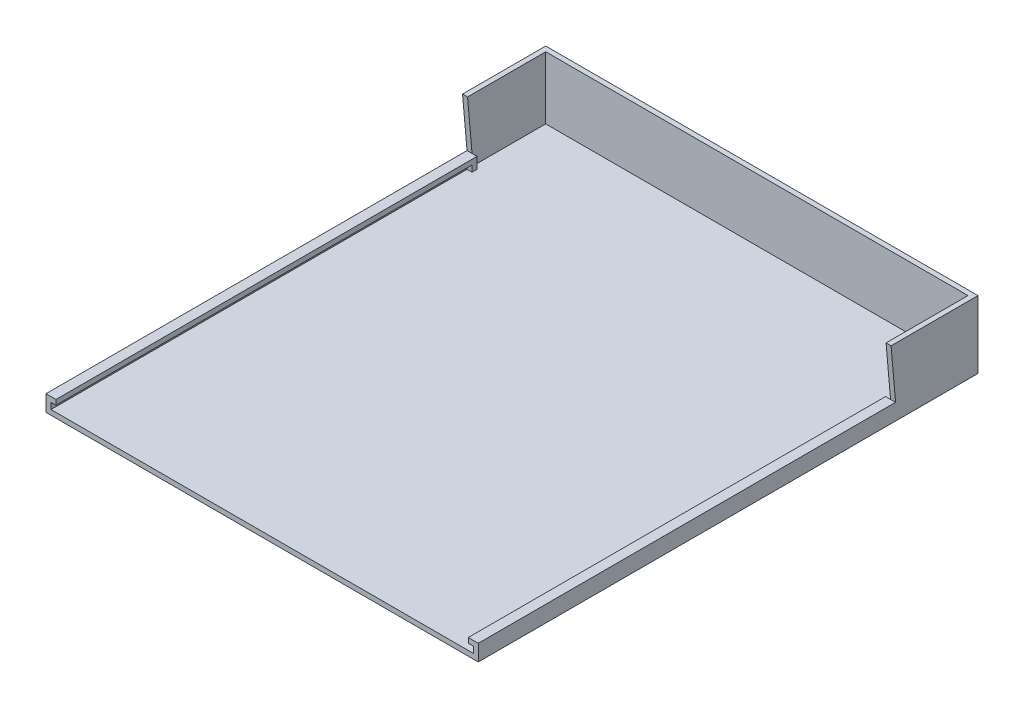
ISO-10303-21;
HEADER;
FILE_DESCRIPTION(('STEP AP214'),'2;1');
FILE_NAME('part.step','',(''),(''),'','','');
FILE_SCHEMA(('AUTOMOTIVE_DESIGN { 1 0 10303 214 1 1 1 1 }'));
ENDSEC;
DATA;
#1=APPLICATION_CONTEXT('core data for automotive mechanical design processes');
#2=APPLICATION_PROTOCOL_DEFINITION('international standard','automotive_design',2000,#1);
#3=PRODUCT_CONTEXT('',#1,'mechanical');
#4=PRODUCT('Part','Part','',(#3));
#5=PRODUCT_RELATED_PRODUCT_CATEGORY('part','',(#4));
#6=PRODUCT_DEFINITION_FORMATION('','',#4);
#7=PRODUCT_DEFINITION_CONTEXT('part definition',#1,'design');
#8=PRODUCT_DEFINITION('design','',#6,#7);
#9=PRODUCT_DEFINITION_SHAPE('','',#8);
#10=(LENGTH_UNIT() NAMED_UNIT(*) SI_UNIT(.MILLI.,.METRE.));
#11=(NAMED_UNIT(*) PLANE_ANGLE_UNIT() SI_UNIT($,.RADIAN.));
#12=(NAMED_UNIT(*) SI_UNIT($,.STERADIAN.) SOLID_ANGLE_UNIT());
#13=UNCERTAINTY_MEASURE_WITH_UNIT(LENGTH_MEASURE(1.E-05),#10,'distance_accuracy_value','');
#14=(GEOMETRIC_REPRESENTATION_CONTEXT(3) GLOBAL_UNCERTAINTY_ASSIGNED_CONTEXT((#13)) GLOBAL_UNIT_ASSIGNED_CONTEXT((#10,
#11,#12)) REPRESENTATION_CONTEXT('',''));
#15=CARTESIAN_POINT('',(0.,0.,0.));
#16=DIRECTION('',(0.,0.,1.));
#17=DIRECTION('',(1.,0.,0.));
#18=AXIS2_PLACEMENT_3D('',#15,#16,#17);
#19=CARTESIAN_POINT('',(0.,2.,0.));
#20=DIRECTION('',(0.,-1.,0.));
#21=DIRECTION('',(0.,0.,-1.));
#22=AXIS2_PLACEMENT_3D('',#19,#20,#21);
#23=PLANE('',#22);
#24=DIRECTION('',(-1.,0.,0.));
#25=VECTOR('',#24,1.);
#26=CARTESIAN_POINT('',(82.5,2.,-67.));
#27=LINE('',#26,#25);
#28=CARTESIAN_POINT('',(84.5,2.,-67.));
#29=VERTEX_POINT('',#28);
#30=CARTESIAN_POINT('',(82.5,2.,-67.));
#31=VERTEX_POINT('',#30);
#32=EDGE_CURVE('E268',#29,#31,#27,.T.);
#33=ORIENTED_EDGE('',*,*,#32,.F.);
#34=DIRECTION('',(0.,0.,-1.));
#35=VECTOR('',#34,1.);
#36=CARTESIAN_POINT('',(84.5,2.,-67.));
#37=LINE('',#36,#35);
#38=CARTESIAN_POINT('',(84.5,2.,-98.));
#39=VERTEX_POINT('',#38);
#40=EDGE_CURVE('E65',#29,#39,#37,.T.);
#41=ORIENTED_EDGE('',*,*,#40,.T.);
#42=DIRECTION('',(-1.,0.,0.));
#43=VECTOR('',#42,1.);
#44=CARTESIAN_POINT('',(84.5,2.,-98.));
#45=LINE('',#44,#43);
#46=CARTESIAN_POINT('',(-84.5,2.,-98.));
#47=VERTEX_POINT('',#46);
#48=EDGE_CURVE('E60',#39,#47,#45,.T.);
#49=ORIENTED_EDGE('',*,*,#48,.T.);
#50=DIRECTION('',(0.,0.,1.));
#51=VECTOR('',#50,1.);
#52=CARTESIAN_POINT('',(-84.5,2.,-98.));
#53=LINE('',#52,#51);
#54=CARTESIAN_POINT('',(-84.5,2.,-68.5));
#55=VERTEX_POINT('',#54);
#56=EDGE_CURVE('E199',#47,#55,#53,.T.);
#57=ORIENTED_EDGE('',*,*,#56,.T.);
#58=DIRECTION('',(-1.,0.,0.));
#59=VECTOR('',#58,1.);
#60=CARTESIAN_POINT('',(-86.5,2.,-68.5));
#61=LINE('',#60,#59);
#62=CARTESIAN_POINT('',(-82.5,2.,-68.5));
#63=VERTEX_POINT('',#62);
#64=EDGE_CURVE('E253',#63,#55,#61,.T.);
#65=ORIENTED_EDGE('',*,*,#64,.F.);
#66=DIRECTION('',(0.,0.,-1.));
#67=VECTOR('',#66,1.);
#68=CARTESIAN_POINT('',(-82.5,2.,-66.5));
#69=LINE('',#68,#67);
#70=CARTESIAN_POINT('',(-82.5,2.,-66.5));
#71=VERTEX_POINT('',#70);
#72=EDGE_CURVE('E249',#71,#63,#69,.T.);
#73=ORIENTED_EDGE('',*,*,#72,.F.);
#74=DIRECTION('',(1.,0.,0.));
#75=VECTOR('',#74,1.);
#76=CARTESIAN_POINT('',(-86.5,2.,-66.5));
#77=LINE('',#76,#75);
#78=CARTESIAN_POINT('',(-84.5,2.,-66.5));
#79=VERTEX_POINT('',#78);
#80=EDGE_CURVE('E246',#79,#71,#77,.T.);
#81=ORIENTED_EDGE('',*,*,#80,.F.);
#82=DIRECTION('',(0.,0.,-1.));
#83=VECTOR('',#82,1.);
#84=CARTESIAN_POINT('',(-84.5,2.,-100.));
#85=LINE('',#84,#83);
#86=CARTESIAN_POINT('',(-84.5,2.,100.));
#87=VERTEX_POINT('',#86);
#88=EDGE_CURVE('E315',#87,#79,#85,.T.);
#89=ORIENTED_EDGE('',*,*,#88,.F.);
#90=DIRECTION('',(1.,0.,0.));
#91=VECTOR('',#90,1.);
#92=CARTESIAN_POINT('',(-86.5,2.,100.));
#93=LINE('',#92,#91);
#94=CARTESIAN_POINT('',(84.5,2.,100.));
#95=VERTEX_POINT('',#94);
#96=EDGE_CURVE('E332',#87,#95,#93,.T.);
#97=ORIENTED_EDGE('',*,*,#96,.T.);
#98=DIRECTION('',(0.,0.,1.));
#99=VECTOR('',#98,1.);
#100=CARTESIAN_POINT('',(84.5,2.,-100.));
#101=LINE('',#100,#99);
#102=CARTESIAN_POINT('',(84.5,2.,-66.5));
#103=VERTEX_POINT('',#102);
#104=EDGE_CURVE('E321',#103,#95,#101,.T.);
#105=ORIENTED_EDGE('',*,*,#104,.F.);
#106=DIRECTION('',(1.,0.,0.));
#107=VECTOR('',#106,1.);
#108=CARTESIAN_POINT('',(82.5,2.,-66.5));
#109=LINE('',#108,#107);
#110=CARTESIAN_POINT('',(82.5,2.,-66.5));
#111=VERTEX_POINT('',#110);
#112=EDGE_CURVE('E270',#111,#103,#109,.T.);
#113=ORIENTED_EDGE('',*,*,#112,.F.);
#114=DIRECTION('',(0.,0.,1.));
#115=VECTOR('',#114,1.);
#116=CARTESIAN_POINT('',(82.5,2.,-66.5));
#117=LINE('',#116,#115);
#118=EDGE_CURVE('E250',#31,#111,#117,.T.);
#119=ORIENTED_EDGE('',*,*,#118,.F.);
#120=EDGE_LOOP('',(#33,#41,#49,#57,#65,#73,#81,#89,#97,#105,#113,#119));
#121=FACE_BOUND('',#120,.T.);
#122=ADVANCED_FACE('F45',(#121),#23,.F.);
#123=CARTESIAN_POINT('',(-86.5,2.,-100.));
#124=DIRECTION('',(0.,0.,-1.));
#125=DIRECTION('',(-1.,0.,0.));
#126=AXIS2_PLACEMENT_3D('',#123,#124,#125);
#127=PLANE('',#126);
#128=DIRECTION('',(0.,-1.,0.));
#129=VECTOR('',#128,1.);
#130=CARTESIAN_POINT('',(-86.5,2.,-100.));
#131=LINE('',#130,#129);
#132=CARTESIAN_POINT('',(-86.5,27.,-100.));
#133=VERTEX_POINT('',#132);
#134=CARTESIAN_POINT('',(-86.5,0.,-100.));
#135=VERTEX_POINT('',#134);
#136=EDGE_CURVE('E346',#133,#135,#131,.T.);
#137=ORIENTED_EDGE('',*,*,#136,.F.);
#138=DIRECTION('',(1.,0.,0.));
#139=VECTOR('',#138,1.);
#140=CARTESIAN_POINT('',(-86.5,27.,-100.));
#141=LINE('',#140,#139);
#142=CARTESIAN_POINT('',(86.5,27.,-100.));
#143=VERTEX_POINT('',#142);
#144=EDGE_CURVE('E228',#133,#143,#141,.T.);
#145=ORIENTED_EDGE('',*,*,#144,.T.);
#146=DIRECTION('',(0.,-1.,0.));
#147=VECTOR('',#146,1.);
#148=CARTESIAN_POINT('',(86.5,2.,-100.));
#149=LINE('',#148,#147);
#150=CARTESIAN_POINT('',(86.5,0.,-100.));
#151=VERTEX_POINT('',#150);
#152=EDGE_CURVE('E335',#143,#151,#149,.T.);
#153=ORIENTED_EDGE('',*,*,#152,.T.);
#154=DIRECTION('',(1.,0.,0.));
#155=VECTOR('',#154,1.);
#156=CARTESIAN_POINT('',(-86.5,0.,-100.));
#157=LINE('',#156,#155);
#158=EDGE_CURVE('E323',#135,#151,#157,.T.);
#159=ORIENTED_EDGE('',*,*,#158,.F.);
#160=EDGE_LOOP('',(#137,#145,#153,#159));
#161=FACE_BOUND('',#160,.T.);
#162=ADVANCED_FACE('F47',(#161),#127,.T.);
#163=CARTESIAN_POINT('',(84.5,6.5,-100.));
#164=DIRECTION('',(1.,0.,0.));
#165=DIRECTION('',(0.,0.,-1.));
#166=AXIS2_PLACEMENT_3D('',#163,#164,#165);
#167=PLANE('',#166);
#168=DIRECTION('',(0.,0.,1.));
#169=VECTOR('',#168,1.);
#170=CARTESIAN_POINT('',(84.5,4.5,-100.));
#171=LINE('',#170,#169);
#172=CARTESIAN_POINT('',(84.5,4.5,-66.5));
#173=VERTEX_POINT('',#172);
#174=CARTESIAN_POINT('',(84.5,4.5,100.));
#175=VERTEX_POINT('',#174);
#176=EDGE_CURVE('E285',#173,#175,#171,.T.);
#177=ORIENTED_EDGE('',*,*,#176,.F.);
#178=DIRECTION('',(0.,-1.,0.));
#179=VECTOR('',#178,1.);
#180=CARTESIAN_POINT('',(84.5,6.5,-66.5));
#181=LINE('',#180,#179);
#182=EDGE_CURVE('E279',#173,#103,#181,.T.);
#183=ORIENTED_EDGE('',*,*,#182,.T.);
#184=ORIENTED_EDGE('',*,*,#104,.T.);
#185=DIRECTION('',(0.,-1.,0.));
#186=VECTOR('',#185,1.);
#187=CARTESIAN_POINT('',(84.5,6.5,100.));
#188=LINE('',#187,#186);
#189=EDGE_CURVE('E311',#175,#95,#188,.T.);
#190=ORIENTED_EDGE('',*,*,#189,.F.);
#191=EDGE_LOOP('',(#177,#183,#184,#190));
#192=FACE_BOUND('',#191,.T.);
#193=ADVANCED_FACE('F428',(#192),#167,.F.);
#194=CARTESIAN_POINT('',(-84.5,6.5,-100.));
#195=DIRECTION('',(-1.,0.,0.));
#196=DIRECTION('',(0.,0.,1.));
#197=AXIS2_PLACEMENT_3D('',#194,#195,#196);
#198=PLANE('',#197);
#199=ORIENTED_EDGE('',*,*,#88,.T.);
#200=DIRECTION('',(0.,1.,0.));
#201=VECTOR('',#200,1.);
#202=CARTESIAN_POINT('',(-84.5,6.5,-66.5));
#203=LINE('',#202,#201);
#204=CARTESIAN_POINT('',(-84.5,4.5,-66.5));
#205=VERTEX_POINT('',#204);
#206=EDGE_CURVE('E283',#79,#205,#203,.T.);
#207=ORIENTED_EDGE('',*,*,#206,.T.);
#208=DIRECTION('',(0.,0.,-1.));
#209=VECTOR('',#208,1.);
#210=CARTESIAN_POINT('',(-84.5,4.5,100.));
#211=LINE('',#210,#209);
#212=CARTESIAN_POINT('',(-84.5,4.5,100.));
#213=VERTEX_POINT('',#212);
#214=EDGE_CURVE('E298',#213,#205,#211,.T.);
#215=ORIENTED_EDGE('',*,*,#214,.F.);
#216=DIRECTION('',(0.,-1.,0.));
#217=VECTOR('',#216,1.);
#218=CARTESIAN_POINT('',(-84.5,6.5,100.));
#219=LINE('',#218,#217);
#220=EDGE_CURVE('E318',#213,#87,#219,.T.);
#221=ORIENTED_EDGE('',*,*,#220,.T.);
#222=EDGE_LOOP('',(#199,#207,#215,#221));
#223=FACE_BOUND('',#222,.T.);
#224=ADVANCED_FACE('F376',(#223),#198,.F.);
#225=CARTESIAN_POINT('',(-86.5,2.,-100.));
#226=DIRECTION('',(1.,0.,0.));
#227=DIRECTION('',(0.,0.,-1.));
#228=AXIS2_PLACEMENT_3D('',#225,#226,#227);
#229=PLANE('',#228);
#230=DIRECTION('',(0.,0.,1.));
#231=VECTOR('',#230,1.);
#232=CARTESIAN_POINT('',(-86.5,6.5,-100.));
#233=LINE('',#232,#231);
#234=CARTESIAN_POINT('',(-86.5,6.5,-68.5));
#235=VERTEX_POINT('',#234);
#236=CARTESIAN_POINT('',(-86.5,6.5,100.));
#237=VERTEX_POINT('',#236);
#238=EDGE_CURVE('E312',#235,#237,#233,.T.);
#239=ORIENTED_EDGE('',*,*,#238,.F.);
#240=DIRECTION('',(0.,0.996194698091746,0.0871557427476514));
#241=VECTOR('',#240,1.);
#242=CARTESIAN_POINT('',(-86.5,27.,-66.7064823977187));
#243=LINE('',#242,#241);
#244=CARTESIAN_POINT('',(-86.5,27.,-66.7064823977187));
#245=VERTEX_POINT('',#244);
#246=EDGE_CURVE('E208',#235,#245,#243,.T.);
#247=ORIENTED_EDGE('',*,*,#246,.T.);
#248=DIRECTION('',(0.,0.,1.));
#249=VECTOR('',#248,1.);
#250=CARTESIAN_POINT('',(-86.5,27.,-98.));
#251=LINE('',#250,#249);
#252=EDGE_CURVE('E226',#133,#245,#251,.T.);
#253=ORIENTED_EDGE('',*,*,#252,.F.);
#254=ORIENTED_EDGE('',*,*,#136,.T.);
#255=DIRECTION('',(0.,0.,1.));
#256=VECTOR('',#255,1.);
#257=CARTESIAN_POINT('',(-86.5,0.,-100.));
#258=LINE('',#257,#256);
#259=CARTESIAN_POINT('',(-86.5,0.,100.));
#260=VERTEX_POINT('',#259);
#261=EDGE_CURVE('E336',#135,#260,#258,.T.);
#262=ORIENTED_EDGE('',*,*,#261,.T.);
#263=DIRECTION('',(0.,-1.,0.));
#264=VECTOR('',#263,1.);
#265=CARTESIAN_POINT('',(-86.5,2.,100.));
#266=LINE('',#265,#264);
#267=EDGE_CURVE('E348',#237,#260,#266,.T.);
#268=ORIENTED_EDGE('',*,*,#267,.F.);
#269=EDGE_LOOP('',(#239,#247,#253,#254,#262,#268));
#270=FACE_BOUND('',#269,.T.);
#271=ADVANCED_FACE('F413',(#270),#229,.F.);
#272=CARTESIAN_POINT('',(-86.5,2.,100.));
#273=DIRECTION('',(0.,0.,-1.));
#274=DIRECTION('',(-1.,0.,0.));
#275=AXIS2_PLACEMENT_3D('',#272,#273,#274);
#276=PLANE('',#275);
#277=DIRECTION('',(1.,0.,0.));
#278=VECTOR('',#277,1.);
#279=CARTESIAN_POINT('',(-86.5,0.,100.));
#280=LINE('',#279,#278);
#281=CARTESIAN_POINT('',(86.5,0.,100.));
#282=VERTEX_POINT('',#281);
#283=EDGE_CURVE('E342',#260,#282,#280,.T.);
#284=ORIENTED_EDGE('',*,*,#283,.T.);
#285=DIRECTION('',(0.,-1.,0.));
#286=VECTOR('',#285,1.);
#287=CARTESIAN_POINT('',(86.5,2.,100.));
#288=LINE('',#287,#286);
#289=CARTESIAN_POINT('',(86.5,6.5,100.));
#290=VERTEX_POINT('',#289);
#291=EDGE_CURVE('E351',#290,#282,#288,.T.);
#292=ORIENTED_EDGE('',*,*,#291,.F.);
#293=DIRECTION('',(1.,0.,0.));
#294=VECTOR('',#293,1.);
#295=CARTESIAN_POINT('',(84.5,6.5,100.));
#296=LINE('',#295,#294);
#297=CARTESIAN_POINT('',(82.5,6.5,100.));
#298=VERTEX_POINT('',#297);
#299=EDGE_CURVE('E328',#298,#290,#296,.T.);
#300=ORIENTED_EDGE('',*,*,#299,.F.);
#301=DIRECTION('',(0.,1.,0.));
#302=VECTOR('',#301,1.);
#303=CARTESIAN_POINT('',(82.5,6.5,100.));
#304=LINE('',#303,#302);
#305=CARTESIAN_POINT('',(82.5,4.5,100.));
#306=VERTEX_POINT('',#305);
#307=EDGE_CURVE('E288',#306,#298,#304,.T.);
#308=ORIENTED_EDGE('',*,*,#307,.F.);
#309=DIRECTION('',(1.,0.,0.));
#310=VECTOR('',#309,1.);
#311=CARTESIAN_POINT('',(82.5,4.5,100.));
#312=LINE('',#311,#310);
#313=EDGE_CURVE('E294',#306,#175,#312,.T.);
#314=ORIENTED_EDGE('',*,*,#313,.T.);
#315=ORIENTED_EDGE('',*,*,#189,.T.);
#316=ORIENTED_EDGE('',*,*,#96,.F.);
#317=ORIENTED_EDGE('',*,*,#220,.F.);
#318=DIRECTION('',(-1.,0.,0.));
#319=VECTOR('',#318,1.);
#320=CARTESIAN_POINT('',(-82.5,4.5,100.));
#321=LINE('',#320,#319);
#322=CARTESIAN_POINT('',(-82.5,4.5,100.));
#323=VERTEX_POINT('',#322);
#324=EDGE_CURVE('E307',#323,#213,#321,.T.);
#325=ORIENTED_EDGE('',*,*,#324,.F.);
#326=DIRECTION('',(0.,-1.,0.));
#327=VECTOR('',#326,1.);
#328=CARTESIAN_POINT('',(-82.5,6.5,100.));
#329=LINE('',#328,#327);
#330=CARTESIAN_POINT('',(-82.5,6.5,100.));
#331=VERTEX_POINT('',#330);
#332=EDGE_CURVE('E299',#331,#323,#329,.T.);
#333=ORIENTED_EDGE('',*,*,#332,.F.);
#334=DIRECTION('',(1.,0.,0.));
#335=VECTOR('',#334,1.);
#336=CARTESIAN_POINT('',(-86.5,6.5,100.));
#337=LINE('',#336,#335);
#338=EDGE_CURVE('E314',#237,#331,#337,.T.);
#339=ORIENTED_EDGE('',*,*,#338,.F.);
#340=ORIENTED_EDGE('',*,*,#267,.T.);
#341=EDGE_LOOP('',(#284,#292,#300,#308,#314,#315,#316,#317,#325,#333,#339,#340));
#342=FACE_BOUND('',#341,.T.);
#343=ADVANCED_FACE('F387',(#342),#276,.F.);
#344=CARTESIAN_POINT('',(86.5,2.,-100.));
#345=DIRECTION('',(1.,0.,0.));
#346=DIRECTION('',(0.,0.,-1.));
#347=AXIS2_PLACEMENT_3D('',#344,#345,#346);
#348=PLANE('',#347);
#349=ORIENTED_EDGE('',*,*,#152,.F.);
#350=DIRECTION('',(0.,0.,1.));
#351=VECTOR('',#350,1.);
#352=CARTESIAN_POINT('',(86.5,27.,-100.));
#353=LINE('',#352,#351);
#354=CARTESIAN_POINT('',(86.5,27.,-65.2064823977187));
#355=VERTEX_POINT('',#354);
#356=EDGE_CURVE('E231',#143,#355,#353,.T.);
#357=ORIENTED_EDGE('',*,*,#356,.T.);
#358=DIRECTION('',(0.,-0.996194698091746,-0.0871557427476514));
#359=VECTOR('',#358,1.);
#360=CARTESIAN_POINT('',(86.5,27.,-65.2064823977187));
#361=LINE('',#360,#359);
#362=CARTESIAN_POINT('',(86.5,6.5,-67.));
#363=VERTEX_POINT('',#362);
#364=EDGE_CURVE('E207',#355,#363,#361,.T.);
#365=ORIENTED_EDGE('',*,*,#364,.T.);
#366=DIRECTION('',(0.,0.,-1.));
#367=VECTOR('',#366,1.);
#368=CARTESIAN_POINT('',(86.5,6.5,-100.));
#369=LINE('',#368,#367);
#370=EDGE_CURVE('E326',#290,#363,#369,.T.);
#371=ORIENTED_EDGE('',*,*,#370,.F.);
#372=ORIENTED_EDGE('',*,*,#291,.T.);
#373=DIRECTION('',(0.,0.,1.));
#374=VECTOR('',#373,1.);
#375=CARTESIAN_POINT('',(86.5,0.,-100.));
#376=LINE('',#375,#374);
#377=EDGE_CURVE('E339',#151,#282,#376,.T.);
#378=ORIENTED_EDGE('',*,*,#377,.F.);
#379=EDGE_LOOP('',(#349,#357,#365,#371,#372,#378));
#380=FACE_BOUND('',#379,.T.);
#381=ADVANCED_FACE('F404',(#380),#348,.T.);
#382=CARTESIAN_POINT('',(0.,0.,0.));
#383=DIRECTION('',(0.,-1.,0.));
#384=DIRECTION('',(0.,0.,-1.));
#385=AXIS2_PLACEMENT_3D('',#382,#383,#384);
#386=PLANE('',#385);
#387=ORIENTED_EDGE('',*,*,#158,.T.);
#388=ORIENTED_EDGE('',*,*,#377,.T.);
#389=ORIENTED_EDGE('',*,*,#283,.F.);
#390=ORIENTED_EDGE('',*,*,#261,.F.);
#391=EDGE_LOOP('',(#387,#388,#389,#390));
#392=FACE_BOUND('',#391,.T.);
#393=ADVANCED_FACE('F424',(#392),#386,.T.);
#394=CARTESIAN_POINT('',(0.,6.5,0.));
#395=DIRECTION('',(0.,1.,0.));
#396=DIRECTION('',(0.,0.,1.));
#397=AXIS2_PLACEMENT_3D('',#394,#395,#396);
#398=PLANE('',#397);
#399=ORIENTED_EDGE('',*,*,#370,.T.);
#400=DIRECTION('',(-1.,0.,0.));
#401=VECTOR('',#400,1.);
#402=CARTESIAN_POINT('',(82.5,6.5,-67.));
#403=LINE('',#402,#401);
#404=CARTESIAN_POINT('',(84.5,6.5,-67.));
#405=VERTEX_POINT('',#404);
#406=EDGE_CURVE('E271',#363,#405,#403,.T.);
#407=ORIENTED_EDGE('',*,*,#406,.T.);
#408=CARTESIAN_POINT('',(82.5,6.5,-67.));
#409=VERTEX_POINT('',#408);
#410=EDGE_CURVE('E267',#405,#409,#403,.T.);
#411=ORIENTED_EDGE('',*,*,#410,.T.);
#412=DIRECTION('',(0.,0.,-1.));
#413=VECTOR('',#412,1.);
#414=CARTESIAN_POINT('',(82.5,6.5,-100.));
#415=LINE('',#414,#413);
#416=EDGE_CURVE('E291',#298,#409,#415,.T.);
#417=ORIENTED_EDGE('',*,*,#416,.F.);
#418=ORIENTED_EDGE('',*,*,#299,.T.);
#419=EDGE_LOOP('',(#399,#407,#411,#417,#418));
#420=FACE_BOUND('',#419,.T.);
#421=ADVANCED_FACE('F401',(#420),#398,.T.);
#422=CARTESIAN_POINT('',(0.,6.5,0.));
#423=DIRECTION('',(0.,1.,0.));
#424=DIRECTION('',(0.,0.,1.));
#425=AXIS2_PLACEMENT_3D('',#422,#423,#424);
#426=PLANE('',#425);
#427=DIRECTION('',(0.,0.,1.));
#428=VECTOR('',#427,1.);
#429=CARTESIAN_POINT('',(-82.5,6.5,100.));
#430=LINE('',#429,#428);
#431=CARTESIAN_POINT('',(-82.5,6.5,-68.5));
#432=VERTEX_POINT('',#431);
#433=EDGE_CURVE('E305',#432,#331,#430,.T.);
#434=ORIENTED_EDGE('',*,*,#433,.F.);
#435=DIRECTION('',(-1.,0.,0.));
#436=VECTOR('',#435,1.);
#437=CARTESIAN_POINT('',(-86.5,6.5,-68.5));
#438=LINE('',#437,#436);
#439=CARTESIAN_POINT('',(-84.5,6.5,-68.5));
#440=VERTEX_POINT('',#439);
#441=EDGE_CURVE('E241',#432,#440,#438,.T.);
#442=ORIENTED_EDGE('',*,*,#441,.T.);
#443=EDGE_CURVE('E245',#440,#235,#438,.T.);
#444=ORIENTED_EDGE('',*,*,#443,.T.);
#445=ORIENTED_EDGE('',*,*,#238,.T.);
#446=ORIENTED_EDGE('',*,*,#338,.T.);
#447=EDGE_LOOP('',(#434,#442,#444,#445,#446));
#448=FACE_BOUND('',#447,.T.);
#449=ADVANCED_FACE('F420',(#448),#426,.T.);
#450=CARTESIAN_POINT('',(-82.5,4.5,100.));
#451=DIRECTION('',(0.,1.,0.));
#452=DIRECTION('',(0.,0.,1.));
#453=AXIS2_PLACEMENT_3D('',#450,#451,#452);
#454=PLANE('',#453);
#455=ORIENTED_EDGE('',*,*,#214,.T.);
#456=DIRECTION('',(1.,0.,0.));
#457=VECTOR('',#456,1.);
#458=CARTESIAN_POINT('',(-82.5,4.5,-66.5));
#459=LINE('',#458,#457);
#460=CARTESIAN_POINT('',(-82.5,4.5,-66.5));
#461=VERTEX_POINT('',#460);
#462=EDGE_CURVE('E281',#205,#461,#459,.T.);
#463=ORIENTED_EDGE('',*,*,#462,.T.);
#464=DIRECTION('',(0.,0.,-1.));
#465=VECTOR('',#464,1.);
#466=CARTESIAN_POINT('',(-82.5,4.5,100.));
#467=LINE('',#466,#465);
#468=EDGE_CURVE('E302',#323,#461,#467,.T.);
#469=ORIENTED_EDGE('',*,*,#468,.F.);
#470=ORIENTED_EDGE('',*,*,#324,.T.);
#471=EDGE_LOOP('',(#455,#463,#469,#470));
#472=FACE_BOUND('',#471,.T.);
#473=ADVANCED_FACE('F382',(#472),#454,.F.);
#474=CARTESIAN_POINT('',(-82.5,0.,0.));
#475=DIRECTION('',(1.,0.,0.));
#476=DIRECTION('',(0.,0.,-1.));
#477=AXIS2_PLACEMENT_3D('',#474,#475,#476);
#478=PLANE('',#477);
#479=ORIENTED_EDGE('',*,*,#468,.T.);
#480=DIRECTION('',(0.,-1.,0.));
#481=VECTOR('',#480,1.);
#482=CARTESIAN_POINT('',(-82.5,6.5,-66.5));
#483=LINE('',#482,#481);
#484=EDGE_CURVE('E258',#461,#71,#483,.T.);
#485=ORIENTED_EDGE('',*,*,#484,.T.);
#486=ORIENTED_EDGE('',*,*,#72,.T.);
#487=DIRECTION('',(0.,-1.,0.));
#488=VECTOR('',#487,1.);
#489=CARTESIAN_POINT('',(-82.5,6.5,-68.5));
#490=LINE('',#489,#488);
#491=EDGE_CURVE('E244',#432,#63,#490,.T.);
#492=ORIENTED_EDGE('',*,*,#491,.F.);
#493=ORIENTED_EDGE('',*,*,#433,.T.);
#494=ORIENTED_EDGE('',*,*,#332,.T.);
#495=EDGE_LOOP('',(#479,#485,#486,#492,#493,#494));
#496=FACE_BOUND('',#495,.T.);
#497=ADVANCED_FACE('F369',(#496),#478,.T.);
#498=CARTESIAN_POINT('',(82.5,4.5,-100.));
#499=DIRECTION('',(0.,1.,0.));
#500=DIRECTION('',(0.,0.,1.));
#501=AXIS2_PLACEMENT_3D('',#498,#499,#500);
#502=PLANE('',#501);
#503=DIRECTION('',(0.,0.,1.));
#504=VECTOR('',#503,1.);
#505=CARTESIAN_POINT('',(82.5,4.5,-100.));
#506=LINE('',#505,#504);
#507=CARTESIAN_POINT('',(82.5,4.5,-66.5));
#508=VERTEX_POINT('',#507);
#509=EDGE_CURVE('E286',#508,#306,#506,.T.);
#510=ORIENTED_EDGE('',*,*,#509,.F.);
#511=DIRECTION('',(1.,0.,0.));
#512=VECTOR('',#511,1.);
#513=CARTESIAN_POINT('',(82.5,4.5,-66.5));
#514=LINE('',#513,#512);
#515=EDGE_CURVE('E261',#508,#173,#514,.T.);
#516=ORIENTED_EDGE('',*,*,#515,.T.);
#517=ORIENTED_EDGE('',*,*,#176,.T.);
#518=ORIENTED_EDGE('',*,*,#313,.F.);
#519=EDGE_LOOP('',(#510,#516,#517,#518));
#520=FACE_BOUND('',#519,.T.);
#521=ADVANCED_FACE('F429',(#520),#502,.F.);
#522=CARTESIAN_POINT('',(82.5,0.,0.));
#523=DIRECTION('',(-1.,0.,0.));
#524=DIRECTION('',(0.,0.,1.));
#525=AXIS2_PLACEMENT_3D('',#522,#523,#524);
#526=PLANE('',#525);
#527=ORIENTED_EDGE('',*,*,#416,.T.);
#528=DIRECTION('',(0.,-1.,0.));
#529=VECTOR('',#528,1.);
#530=CARTESIAN_POINT('',(82.5,6.5,-67.));
#531=LINE('',#530,#529);
#532=EDGE_CURVE('E264',#409,#31,#531,.T.);
#533=ORIENTED_EDGE('',*,*,#532,.T.);
#534=ORIENTED_EDGE('',*,*,#118,.T.);
#535=DIRECTION('',(0.,-1.,0.));
#536=VECTOR('',#535,1.);
#537=CARTESIAN_POINT('',(82.5,6.5,-66.5));
#538=LINE('',#537,#536);
#539=EDGE_CURVE('E239',#508,#111,#538,.T.);
#540=ORIENTED_EDGE('',*,*,#539,.F.);
#541=ORIENTED_EDGE('',*,*,#509,.T.);
#542=ORIENTED_EDGE('',*,*,#307,.T.);
#543=EDGE_LOOP('',(#527,#533,#534,#540,#541,#542));
#544=FACE_BOUND('',#543,.T.);
#545=ADVANCED_FACE('F397',(#544),#526,.T.);
#546=CARTESIAN_POINT('',(-86.5,6.5,-66.5));
#547=DIRECTION('',(0.,0.,-1.));
#548=DIRECTION('',(-1.,0.,0.));
#549=AXIS2_PLACEMENT_3D('',#546,#547,#548);
#550=PLANE('',#549);
#551=ORIENTED_EDGE('',*,*,#462,.F.);
#552=ORIENTED_EDGE('',*,*,#206,.F.);
#553=ORIENTED_EDGE('',*,*,#80,.T.);
#554=ORIENTED_EDGE('',*,*,#484,.F.);
#555=EDGE_LOOP('',(#551,#552,#553,#554));
#556=FACE_BOUND('',#555,.T.);
#557=ADVANCED_FACE('F380',(#556),#550,.F.);
#558=CARTESIAN_POINT('',(-86.5,6.5,-68.5));
#559=DIRECTION('',(0.,0.,1.));
#560=DIRECTION('',(1.,0.,0.));
#561=AXIS2_PLACEMENT_3D('',#558,#559,#560);
#562=PLANE('',#561);
#563=ORIENTED_EDGE('',*,*,#64,.T.);
#564=DIRECTION('',(0.,1.,0.));
#565=VECTOR('',#564,1.);
#566=CARTESIAN_POINT('',(-84.5,6.5,-68.5));
#567=LINE('',#566,#565);
#568=EDGE_CURVE('E11',#55,#440,#567,.T.);
#569=ORIENTED_EDGE('',*,*,#568,.T.);
#570=ORIENTED_EDGE('',*,*,#441,.F.);
#571=ORIENTED_EDGE('',*,*,#491,.T.);
#572=EDGE_LOOP('',(#563,#569,#570,#571));
#573=FACE_BOUND('',#572,.T.);
#574=ADVANCED_FACE('F365',(#573),#562,.F.);
#575=CARTESIAN_POINT('',(82.5,6.5,-66.5));
#576=DIRECTION('',(0.,0.,-1.));
#577=DIRECTION('',(-1.,0.,0.));
#578=AXIS2_PLACEMENT_3D('',#575,#576,#577);
#579=PLANE('',#578);
#580=ORIENTED_EDGE('',*,*,#112,.T.);
#581=ORIENTED_EDGE('',*,*,#182,.F.);
#582=ORIENTED_EDGE('',*,*,#515,.F.);
#583=ORIENTED_EDGE('',*,*,#539,.T.);
#584=EDGE_LOOP('',(#580,#581,#582,#583));
#585=FACE_BOUND('',#584,.T.);
#586=ADVANCED_FACE('F393',(#585),#579,.F.);
#587=CARTESIAN_POINT('',(82.5,6.5,-67.));
#588=DIRECTION('',(0.,0.,1.));
#589=DIRECTION('',(1.,0.,0.));
#590=AXIS2_PLACEMENT_3D('',#587,#588,#589);
#591=PLANE('',#590);
#592=ORIENTED_EDGE('',*,*,#410,.F.);
#593=DIRECTION('',(0.,-1.,0.));
#594=VECTOR('',#593,1.);
#595=CARTESIAN_POINT('',(84.5,6.5,-67.));
#596=LINE('',#595,#594);
#597=EDGE_CURVE('E53',#405,#29,#596,.T.);
#598=ORIENTED_EDGE('',*,*,#597,.T.);
#599=ORIENTED_EDGE('',*,*,#32,.T.);
#600=ORIENTED_EDGE('',*,*,#532,.F.);
#601=EDGE_LOOP('',(#592,#598,#599,#600));
#602=FACE_BOUND('',#601,.T.);
#603=ADVANCED_FACE('F354',(#602),#591,.F.);
#604=CARTESIAN_POINT('',(84.5,27.,-67.));
#605=DIRECTION('',(-1.,0.,0.));
#606=DIRECTION('',(0.,0.,1.));
#607=AXIS2_PLACEMENT_3D('',#604,#605,#606);
#608=PLANE('',#607);
#609=ORIENTED_EDGE('',*,*,#40,.F.);
#610=ORIENTED_EDGE('',*,*,#597,.F.);
#611=DIRECTION('',(0.,-0.996194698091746,-0.0871557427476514));
#612=VECTOR('',#611,1.);
#613=CARTESIAN_POINT('',(84.5,27.,-65.2064823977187));
#614=LINE('',#613,#612);
#615=CARTESIAN_POINT('',(84.5,27.,-65.2064823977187));
#616=VERTEX_POINT('',#615);
#617=EDGE_CURVE('E205',#616,#405,#614,.T.);
#618=ORIENTED_EDGE('',*,*,#617,.F.);
#619=DIRECTION('',(0.,0.,-1.));
#620=VECTOR('',#619,1.);
#621=CARTESIAN_POINT('',(84.5,27.,-67.));
#622=LINE('',#621,#620);
#623=CARTESIAN_POINT('',(84.5,27.,-98.));
#624=VERTEX_POINT('',#623);
#625=EDGE_CURVE('E188',#616,#624,#622,.T.);
#626=ORIENTED_EDGE('',*,*,#625,.T.);
#627=DIRECTION('',(0.,-1.,0.));
#628=VECTOR('',#627,1.);
#629=CARTESIAN_POINT('',(84.5,27.,-98.));
#630=LINE('',#629,#628);
#631=EDGE_CURVE('E233',#624,#39,#630,.T.);
#632=ORIENTED_EDGE('',*,*,#631,.T.);
#633=EDGE_LOOP('',(#609,#610,#618,#626,#632));
#634=FACE_BOUND('',#633,.T.);
#635=ADVANCED_FACE('F211',(#634),#608,.T.);
#636=CARTESIAN_POINT('',(-84.5,27.,-98.));
#637=DIRECTION('',(1.,0.,0.));
#638=DIRECTION('',(0.,0.,-1.));
#639=AXIS2_PLACEMENT_3D('',#636,#637,#638);
#640=PLANE('',#639);
#641=ORIENTED_EDGE('',*,*,#56,.F.);
#642=DIRECTION('',(0.,-1.,0.));
#643=VECTOR('',#642,1.);
#644=CARTESIAN_POINT('',(-84.5,27.,-98.));
#645=LINE('',#644,#643);
#646=CARTESIAN_POINT('',(-84.5,27.,-98.));
#647=VERTEX_POINT('',#646);
#648=EDGE_CURVE('E237',#647,#47,#645,.T.);
#649=ORIENTED_EDGE('',*,*,#648,.F.);
#650=DIRECTION('',(0.,0.,1.));
#651=VECTOR('',#650,1.);
#652=CARTESIAN_POINT('',(-84.5,27.,-98.));
#653=LINE('',#652,#651);
#654=CARTESIAN_POINT('',(-84.5,27.,-66.7064823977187));
#655=VERTEX_POINT('',#654);
#656=EDGE_CURVE('E224',#647,#655,#653,.T.);
#657=ORIENTED_EDGE('',*,*,#656,.T.);
#658=DIRECTION('',(0.,0.996194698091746,0.0871557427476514));
#659=VECTOR('',#658,1.);
#660=CARTESIAN_POINT('',(-84.5,27.,-66.7064823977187));
#661=LINE('',#660,#659);
#662=EDGE_CURVE('E215',#440,#655,#661,.T.);
#663=ORIENTED_EDGE('',*,*,#662,.F.);
#664=ORIENTED_EDGE('',*,*,#568,.F.);
#665=EDGE_LOOP('',(#641,#649,#657,#663,#664));
#666=FACE_BOUND('',#665,.T.);
#667=ADVANCED_FACE('F362',(#666),#640,.T.);
#668=CARTESIAN_POINT('',(84.5,27.,-98.));
#669=DIRECTION('',(0.,0.,1.));
#670=DIRECTION('',(1.,0.,0.));
#671=AXIS2_PLACEMENT_3D('',#668,#669,#670);
#672=PLANE('',#671);
#673=ORIENTED_EDGE('',*,*,#48,.F.);
#674=ORIENTED_EDGE('',*,*,#631,.F.);
#675=DIRECTION('',(-1.,0.,0.));
#676=VECTOR('',#675,1.);
#677=CARTESIAN_POINT('',(84.5,27.,-98.));
#678=LINE('',#677,#676);
#679=EDGE_CURVE('E196',#624,#647,#678,.T.);
#680=ORIENTED_EDGE('',*,*,#679,.T.);
#681=ORIENTED_EDGE('',*,*,#648,.T.);
#682=EDGE_LOOP('',(#673,#674,#680,#681));
#683=FACE_BOUND('',#682,.T.);
#684=ADVANCED_FACE('F358',(#683),#672,.T.);
#685=CARTESIAN_POINT('',(0.,27.,0.));
#686=DIRECTION('',(0.,1.,0.));
#687=DIRECTION('',(0.,0.,1.));
#688=AXIS2_PLACEMENT_3D('',#685,#686,#687);
#689=PLANE('',#688);
#690=ORIENTED_EDGE('',*,*,#625,.F.);
#691=DIRECTION('',(1.,0.,0.));
#692=VECTOR('',#691,1.);
#693=CARTESIAN_POINT('',(84.5,27.,-65.2064823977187));
#694=LINE('',#693,#692);
#695=EDGE_CURVE('E192',#616,#355,#694,.T.);
#696=ORIENTED_EDGE('',*,*,#695,.T.);
#697=ORIENTED_EDGE('',*,*,#356,.F.);
#698=ORIENTED_EDGE('',*,*,#144,.F.);
#699=ORIENTED_EDGE('',*,*,#252,.T.);
#700=DIRECTION('',(-1.,0.,0.));
#701=VECTOR('',#700,1.);
#702=CARTESIAN_POINT('',(-84.5,27.,-66.7064823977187));
#703=LINE('',#702,#701);
#704=EDGE_CURVE('E218',#655,#245,#703,.T.);
#705=ORIENTED_EDGE('',*,*,#704,.F.);
#706=ORIENTED_EDGE('',*,*,#656,.F.);
#707=ORIENTED_EDGE('',*,*,#679,.F.);
#708=EDGE_LOOP('',(#690,#696,#697,#698,#699,#705,#706,#707));
#709=FACE_BOUND('',#708,.T.);
#710=ADVANCED_FACE('F190',(#709),#689,.T.);
#711=CARTESIAN_POINT('',(-84.5,27.,-66.7064823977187));
#712=DIRECTION('',(0.,-0.0871557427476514,0.996194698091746));
#713=DIRECTION('',(0.,-0.996194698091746,-0.0871557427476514));
#714=AXIS2_PLACEMENT_3D('',#711,#712,#713);
#715=PLANE('',#714);
#716=ORIENTED_EDGE('',*,*,#246,.F.);
#717=ORIENTED_EDGE('',*,*,#443,.F.);
#718=ORIENTED_EDGE('',*,*,#662,.T.);
#719=ORIENTED_EDGE('',*,*,#704,.T.);
#720=EDGE_LOOP('',(#716,#717,#718,#719));
#721=FACE_BOUND('',#720,.T.);
#722=ADVANCED_FACE('F417',(#721),#715,.T.);
#723=CARTESIAN_POINT('',(84.5,27.,-65.2064823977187));
#724=DIRECTION('',(0.,-0.0871557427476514,0.996194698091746));
#725=DIRECTION('',(0.,-0.996194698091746,-0.0871557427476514));
#726=AXIS2_PLACEMENT_3D('',#723,#724,#725);
#727=PLANE('',#726);
#728=ORIENTED_EDGE('',*,*,#364,.F.);
#729=ORIENTED_EDGE('',*,*,#695,.F.);
#730=ORIENTED_EDGE('',*,*,#617,.T.);
#731=ORIENTED_EDGE('',*,*,#406,.F.);
#732=EDGE_LOOP('',(#728,#729,#730,#731));
#733=FACE_BOUND('',#732,.T.);
#734=ADVANCED_FACE('F203',(#733),#727,.T.);
#735=CLOSED_SHELL('',(#122,#162,#193,#224,#271,#343,#381,#393,#421,#449,#473,#497,#521,#545,
#557,#574,#586,#603,#635,#667,#684,#710,#722,#734));
#736=MANIFOLD_SOLID_BREP('B2',#735);
#737=ADVANCED_BREP_SHAPE_REPRESENTATION('',(#18,#736),#14);
#738=SHAPE_DEFINITION_REPRESENTATION(#9,#737);
ENDSEC;
END-ISO-10303-21;
